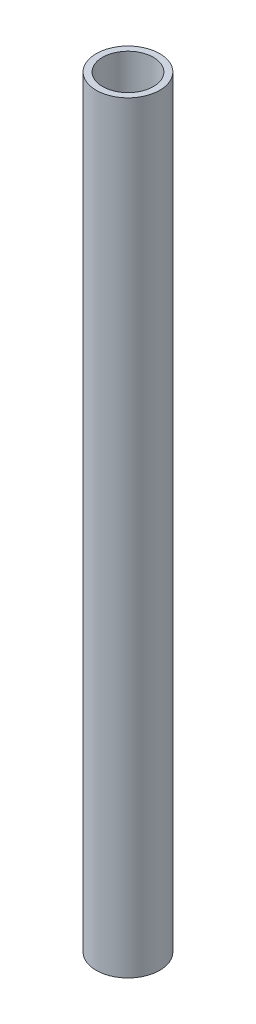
ISO-10303-21;
HEADER;
FILE_DESCRIPTION(('STEP AP214'),'2;1');
FILE_NAME('part.step','',(''),(''),'','','');
FILE_SCHEMA(('AUTOMOTIVE_DESIGN { 1 0 10303 214 1 1 1 1 }'));
ENDSEC;
DATA;
#1=APPLICATION_CONTEXT('core data for automotive mechanical design processes');
#2=APPLICATION_PROTOCOL_DEFINITION('international standard','automotive_design',2000,#1);
#3=PRODUCT_CONTEXT('',#1,'mechanical');
#4=PRODUCT('Part','Part','',(#3));
#5=PRODUCT_RELATED_PRODUCT_CATEGORY('part','',(#4));
#6=PRODUCT_DEFINITION_FORMATION('','',#4);
#7=PRODUCT_DEFINITION_CONTEXT('part definition',#1,'design');
#8=PRODUCT_DEFINITION('design','',#6,#7);
#9=PRODUCT_DEFINITION_SHAPE('','',#8);
#10=(LENGTH_UNIT() NAMED_UNIT(*) SI_UNIT(.MILLI.,.METRE.));
#11=(NAMED_UNIT(*) PLANE_ANGLE_UNIT() SI_UNIT($,.RADIAN.));
#12=(NAMED_UNIT(*) SI_UNIT($,.STERADIAN.) SOLID_ANGLE_UNIT());
#13=UNCERTAINTY_MEASURE_WITH_UNIT(LENGTH_MEASURE(1.E-05),#10,'distance_accuracy_value','');
#14=(GEOMETRIC_REPRESENTATION_CONTEXT(3) GLOBAL_UNCERTAINTY_ASSIGNED_CONTEXT((#13)) GLOBAL_UNIT_ASSIGNED_CONTEXT((#10,
#11,#12)) REPRESENTATION_CONTEXT('',''));
#15=CARTESIAN_POINT('',(0.,0.,0.));
#16=DIRECTION('',(0.,0.,1.));
#17=DIRECTION('',(1.,0.,0.));
#18=AXIS2_PLACEMENT_3D('',#15,#16,#17);
#19=CARTESIAN_POINT('',(0.,120.,0.));
#20=DIRECTION('',(0.,1.,0.));
#21=DIRECTION('',(0.,0.,1.));
#22=AXIS2_PLACEMENT_3D('',#19,#20,#21);
#23=PLANE('',#22);
#24=CARTESIAN_POINT('',(0.,120.,0.));
#25=DIRECTION('',(0.,1.,0.));
#26=DIRECTION('',(0.,0.,1.));
#27=AXIS2_PLACEMENT_3D('',#24,#25,#26);
#28=CIRCLE('',#27,5.);
#29=CARTESIAN_POINT('',(0.,120.,5.));
#30=VERTEX_POINT('',#29);
#31=EDGE_CURVE('E10',#30,#30,#28,.T.);
#32=ORIENTED_EDGE('',*,*,#31,.T.);
#33=EDGE_LOOP('',(#32));
#34=FACE_BOUND('',#33,.T.);
#35=CARTESIAN_POINT('',(0.,120.,0.));
#36=DIRECTION('',(0.,1.,0.));
#37=DIRECTION('',(0.,0.,1.));
#38=AXIS2_PLACEMENT_3D('',#35,#36,#37);
#39=CIRCLE('',#38,4.);
#40=CARTESIAN_POINT('',(0.,120.,4.));
#41=VERTEX_POINT('',#40);
#42=EDGE_CURVE('E45',#41,#41,#39,.T.);
#43=ORIENTED_EDGE('',*,*,#42,.F.);
#44=EDGE_LOOP('',(#43));
#45=FACE_BOUND('',#44,.T.);
#46=ADVANCED_FACE('F34',(#34,#45),#23,.T.);
#47=CARTESIAN_POINT('',(0.,0.,0.));
#48=DIRECTION('',(0.,1.,0.));
#49=DIRECTION('',(0.,0.,1.));
#50=AXIS2_PLACEMENT_3D('',#47,#48,#49);
#51=PLANE('',#50);
#52=CARTESIAN_POINT('',(0.,0.,0.));
#53=DIRECTION('',(0.,1.,0.));
#54=DIRECTION('',(0.,0.,1.));
#55=AXIS2_PLACEMENT_3D('',#52,#53,#54);
#56=CIRCLE('',#55,5.);
#57=CARTESIAN_POINT('',(0.,0.,5.));
#58=VERTEX_POINT('',#57);
#59=EDGE_CURVE('E38',#58,#58,#56,.T.);
#60=ORIENTED_EDGE('',*,*,#59,.F.);
#61=EDGE_LOOP('',(#60));
#62=FACE_BOUND('',#61,.T.);
#63=CARTESIAN_POINT('',(0.,0.,0.));
#64=DIRECTION('',(0.,1.,0.));
#65=DIRECTION('',(0.,0.,1.));
#66=AXIS2_PLACEMENT_3D('',#63,#64,#65);
#67=CIRCLE('',#66,4.);
#68=CARTESIAN_POINT('',(0.,0.,4.));
#69=VERTEX_POINT('',#68);
#70=EDGE_CURVE('E47',#69,#69,#67,.T.);
#71=ORIENTED_EDGE('',*,*,#70,.T.);
#72=EDGE_LOOP('',(#71));
#73=FACE_BOUND('',#72,.T.);
#74=ADVANCED_FACE('F57',(#62,#73),#51,.F.);
#75=CARTESIAN_POINT('',(0.,120.,0.));
#76=DIRECTION('',(0.,-1.,0.));
#77=DIRECTION('',(0.,0.,-1.));
#78=AXIS2_PLACEMENT_3D('',#75,#76,#77);
#79=CYLINDRICAL_SURFACE('',#78,5.);
#80=ORIENTED_EDGE('',*,*,#31,.F.);
#81=EDGE_LOOP('',(#80));
#82=FACE_BOUND('',#81,.T.);
#83=ORIENTED_EDGE('',*,*,#59,.T.);
#84=EDGE_LOOP('',(#83));
#85=FACE_BOUND('',#84,.T.);
#86=ADVANCED_FACE('F36',(#82,#85),#79,.T.);
#87=CARTESIAN_POINT('',(0.,120.,0.));
#88=DIRECTION('',(0.,-1.,0.));
#89=DIRECTION('',(0.,0.,-1.));
#90=AXIS2_PLACEMENT_3D('',#87,#88,#89);
#91=CYLINDRICAL_SURFACE('',#90,4.);
#92=ORIENTED_EDGE('',*,*,#42,.T.);
#93=EDGE_LOOP('',(#92));
#94=FACE_BOUND('',#93,.T.);
#95=ORIENTED_EDGE('',*,*,#70,.F.);
#96=EDGE_LOOP('',(#95));
#97=FACE_BOUND('',#96,.T.);
#98=ADVANCED_FACE('F53',(#94,#97),#91,.F.);
#99=CLOSED_SHELL('',(#46,#74,#86,#98));
#100=MANIFOLD_SOLID_BREP('B2',#99);
#101=ADVANCED_BREP_SHAPE_REPRESENTATION('',(#18,#100),#14);
#102=SHAPE_DEFINITION_REPRESENTATION(#9,#101);
ENDSEC;
END-ISO-10303-21;
